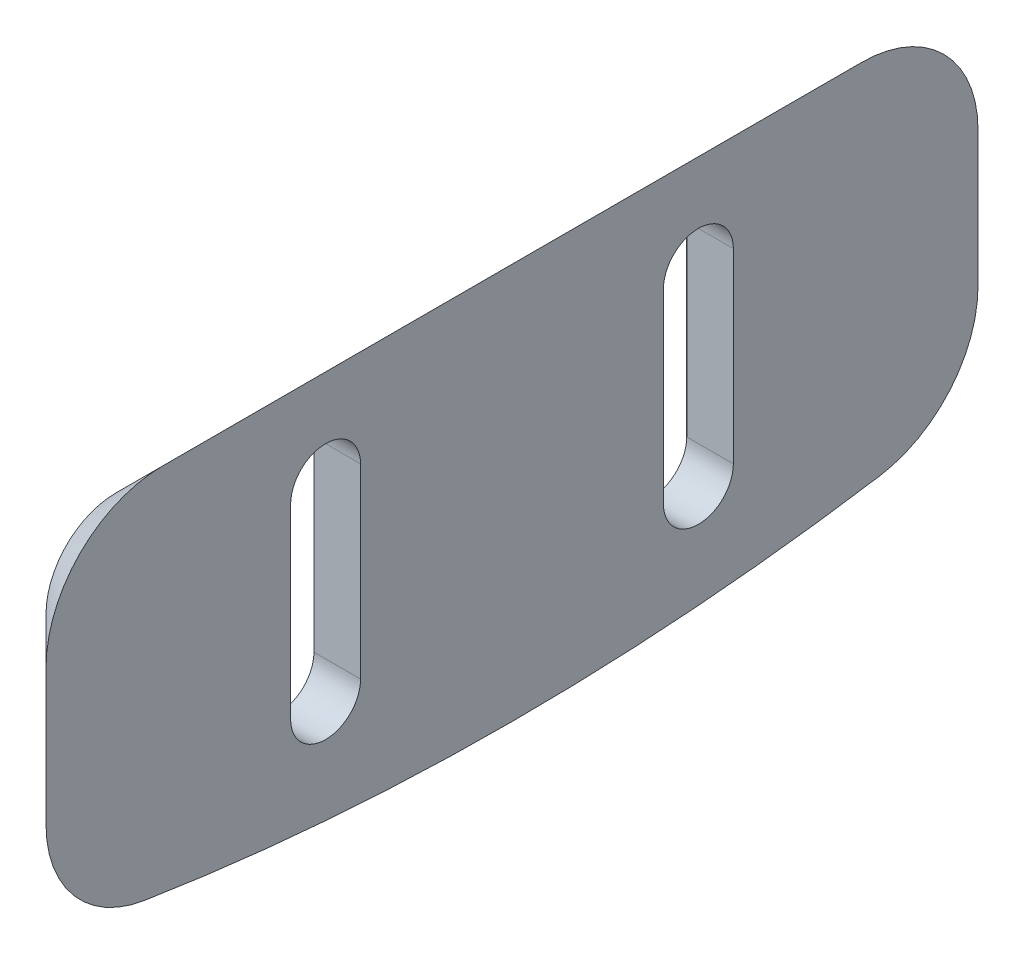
ISO-10303-21;
HEADER;
FILE_DESCRIPTION(('STEP AP214'),'2;1');
FILE_NAME('part.step','',(''),(''),'','','');
FILE_SCHEMA(('AUTOMOTIVE_DESIGN { 1 0 10303 214 1 1 1 1 }'));
ENDSEC;
DATA;
#1=APPLICATION_CONTEXT('core data for automotive mechanical design processes');
#2=APPLICATION_PROTOCOL_DEFINITION('international standard','automotive_design',2000,#1);
#3=PRODUCT_CONTEXT('',#1,'mechanical');
#4=PRODUCT('Part','Part','',(#3));
#5=PRODUCT_RELATED_PRODUCT_CATEGORY('part','',(#4));
#6=PRODUCT_DEFINITION_FORMATION('','',#4);
#7=PRODUCT_DEFINITION_CONTEXT('part definition',#1,'design');
#8=PRODUCT_DEFINITION('design','',#6,#7);
#9=PRODUCT_DEFINITION_SHAPE('','',#8);
#10=(LENGTH_UNIT() NAMED_UNIT(*) SI_UNIT(.MILLI.,.METRE.));
#11=(NAMED_UNIT(*) PLANE_ANGLE_UNIT() SI_UNIT($,.RADIAN.));
#12=(NAMED_UNIT(*) SI_UNIT($,.STERADIAN.) SOLID_ANGLE_UNIT());
#13=UNCERTAINTY_MEASURE_WITH_UNIT(LENGTH_MEASURE(1.E-05),#10,'distance_accuracy_value','');
#14=(GEOMETRIC_REPRESENTATION_CONTEXT(3) GLOBAL_UNCERTAINTY_ASSIGNED_CONTEXT((#13)) GLOBAL_UNIT_ASSIGNED_CONTEXT((#10,
#11,#12)) REPRESENTATION_CONTEXT('',''));
#15=CARTESIAN_POINT('',(0.,0.,0.));
#16=DIRECTION('',(0.,0.,1.));
#17=DIRECTION('',(1.,0.,0.));
#18=AXIS2_PLACEMENT_3D('',#15,#16,#17);
#19=CARTESIAN_POINT('',(2.,101.,0.));
#20=DIRECTION('',(1.,0.,0.));
#21=DIRECTION('',(0.,0.,-1.));
#22=AXIS2_PLACEMENT_3D('',#19,#20,#21);
#23=PLANE('',#22);
#24=CARTESIAN_POINT('',(2.,4.83217793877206,8.));
#25=DIRECTION('',(1.,0.,0.));
#26=DIRECTION('',(0.,0.,-1.));
#27=AXIS2_PLACEMENT_3D('',#24,#25,#26);
#28=CIRCLE('',#27,1.5);
#29=CARTESIAN_POINT('',(2.,4.83217793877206,9.5));
#30=VERTEX_POINT('',#29);
#31=CARTESIAN_POINT('',(2.,4.83217793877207,6.5));
#32=VERTEX_POINT('',#31);
#33=EDGE_CURVE('E164',#30,#32,#28,.T.);
#34=ORIENTED_EDGE('',*,*,#33,.F.);
#35=DIRECTION('',(0.,-1.,0.));
#36=VECTOR('',#35,1.);
#37=CARTESIAN_POINT('',(2.,4.83217793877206,9.5));
#38=LINE('',#37,#36);
#39=CARTESIAN_POINT('',(2.,12.8321779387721,9.5));
#40=VERTEX_POINT('',#39);
#41=EDGE_CURVE('E182',#40,#30,#38,.T.);
#42=ORIENTED_EDGE('',*,*,#41,.F.);
#43=CARTESIAN_POINT('',(2.,12.8321779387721,8.));
#44=DIRECTION('',(1.,0.,0.));
#45=DIRECTION('',(0.,0.,-1.));
#46=AXIS2_PLACEMENT_3D('',#43,#44,#45);
#47=CIRCLE('',#46,1.5);
#48=CARTESIAN_POINT('',(2.,12.8321779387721,6.5));
#49=VERTEX_POINT('',#48);
#50=EDGE_CURVE('E185',#49,#40,#47,.T.);
#51=ORIENTED_EDGE('',*,*,#50,.F.);
#52=DIRECTION('',(0.,1.,0.));
#53=VECTOR('',#52,1.);
#54=CARTESIAN_POINT('',(2.,4.83217793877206,6.5));
#55=LINE('',#54,#53);
#56=EDGE_CURVE('E191',#32,#49,#55,.T.);
#57=ORIENTED_EDGE('',*,*,#56,.F.);
#58=EDGE_LOOP('',(#34,#42,#51,#57));
#59=FACE_BOUND('',#58,.T.);
#60=CARTESIAN_POINT('',(2.,4.83217793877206,-8.));
#61=DIRECTION('',(1.,0.,0.));
#62=DIRECTION('',(0.,0.,1.));
#63=AXIS2_PLACEMENT_3D('',#60,#61,#62);
#64=CIRCLE('',#63,1.5);
#65=CARTESIAN_POINT('',(2.,4.83217793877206,-6.5));
#66=VERTEX_POINT('',#65);
#67=CARTESIAN_POINT('',(2.,4.83217793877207,-9.5));
#68=VERTEX_POINT('',#67);
#69=EDGE_CURVE('E192',#66,#68,#64,.T.);
#70=ORIENTED_EDGE('',*,*,#69,.F.);
#71=DIRECTION('',(0.,-1.,0.));
#72=VECTOR('',#71,1.);
#73=CARTESIAN_POINT('',(2.,4.83217793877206,-6.5));
#74=LINE('',#73,#72);
#75=CARTESIAN_POINT('',(2.,12.8321779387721,-6.5));
#76=VERTEX_POINT('',#75);
#77=EDGE_CURVE('E212',#76,#66,#74,.T.);
#78=ORIENTED_EDGE('',*,*,#77,.F.);
#79=CARTESIAN_POINT('',(2.,12.8321779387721,-8.));
#80=DIRECTION('',(1.,0.,0.));
#81=DIRECTION('',(0.,0.,1.));
#82=AXIS2_PLACEMENT_3D('',#79,#80,#81);
#83=CIRCLE('',#82,1.5);
#84=CARTESIAN_POINT('',(2.,12.8321779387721,-9.5));
#85=VERTEX_POINT('',#84);
#86=EDGE_CURVE('E215',#85,#76,#83,.T.);
#87=ORIENTED_EDGE('',*,*,#86,.F.);
#88=DIRECTION('',(0.,1.,0.));
#89=VECTOR('',#88,1.);
#90=CARTESIAN_POINT('',(2.,4.83217793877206,-9.5));
#91=LINE('',#90,#89);
#92=EDGE_CURVE('E219',#68,#85,#91,.T.);
#93=ORIENTED_EDGE('',*,*,#92,.F.);
#94=EDGE_LOOP('',(#70,#78,#87,#93));
#95=FACE_BOUND('',#94,.T.);
#96=DIRECTION('',(0.,1.,0.));
#97=VECTOR('',#96,1.);
#98=CARTESIAN_POINT('',(2.,2.,-20.));
#99=LINE('',#98,#97);
#100=CARTESIAN_POINT('',(2.,6.17911622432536,-20.));
#101=VERTEX_POINT('',#100);
#102=CARTESIAN_POINT('',(2.,12.,-20.));
#103=VERTEX_POINT('',#102);
#104=EDGE_CURVE('E198',#101,#103,#99,.T.);
#105=ORIENTED_EDGE('',*,*,#104,.T.);
#106=CARTESIAN_POINT('',(2.,12.,-15.));
#107=DIRECTION('',(1.,0.,0.));
#108=DIRECTION('',(0.,0.,-1.));
#109=AXIS2_PLACEMENT_3D('',#106,#107,#108);
#110=CIRCLE('',#109,5.);
#111=CARTESIAN_POINT('',(2.,17.,-15.));
#112=VERTEX_POINT('',#111);
#113=EDGE_CURVE('E247',#103,#112,#110,.T.);
#114=ORIENTED_EDGE('',*,*,#113,.T.);
#115=DIRECTION('',(0.,0.,1.));
#116=VECTOR('',#115,1.);
#117=CARTESIAN_POINT('',(2.,17.,20.));
#118=LINE('',#117,#116);
#119=CARTESIAN_POINT('',(2.,17.,15.));
#120=VERTEX_POINT('',#119);
#121=EDGE_CURVE('E234',#112,#120,#118,.T.);
#122=ORIENTED_EDGE('',*,*,#121,.T.);
#123=CARTESIAN_POINT('',(2.,12.,15.));
#124=DIRECTION('',(1.,0.,0.));
#125=DIRECTION('',(0.,0.,-1.));
#126=AXIS2_PLACEMENT_3D('',#123,#124,#125);
#127=CIRCLE('',#126,5.);
#128=CARTESIAN_POINT('',(2.,12.,20.));
#129=VERTEX_POINT('',#128);
#130=EDGE_CURVE('E245',#120,#129,#127,.T.);
#131=ORIENTED_EDGE('',*,*,#130,.T.);
#132=DIRECTION('',(0.,-1.,0.));
#133=VECTOR('',#132,1.);
#134=CARTESIAN_POINT('',(2.,2.,20.));
#135=LINE('',#134,#133);
#136=CARTESIAN_POINT('',(2.,6.17911622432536,20.));
#137=VERTEX_POINT('',#136);
#138=EDGE_CURVE('E236',#129,#137,#135,.T.);
#139=ORIENTED_EDGE('',*,*,#138,.T.);
#140=CARTESIAN_POINT('',(2.,6.17911622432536,15.));
#141=DIRECTION('',(1.,0.,0.));
#142=DIRECTION('',(0.,0.,-1.));
#143=AXIS2_PLACEMENT_3D('',#140,#141,#142);
#144=CIRCLE('',#143,5.);
#145=CARTESIAN_POINT('',(2.,1.24052852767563,15.78125));
#146=VERTEX_POINT('',#145);
#147=EDGE_CURVE('E243',#137,#146,#144,.T.);
#148=ORIENTED_EDGE('',*,*,#147,.T.);
#149=CARTESIAN_POINT('',(2.,101.,0.));
#150=DIRECTION('',(1.,0.,0.));
#151=DIRECTION('',(0.,0.,-1.));
#152=AXIS2_PLACEMENT_3D('',#149,#150,#151);
#153=CIRCLE('',#152,101.);
#154=CARTESIAN_POINT('',(2.,1.24052852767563,-15.78125));
#155=VERTEX_POINT('',#154);
#156=EDGE_CURVE('E238',#146,#155,#153,.T.);
#157=ORIENTED_EDGE('',*,*,#156,.T.);
#158=CARTESIAN_POINT('',(2.,6.17911622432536,-15.));
#159=DIRECTION('',(1.,0.,0.));
#160=DIRECTION('',(0.,0.,-1.));
#161=AXIS2_PLACEMENT_3D('',#158,#159,#160);
#162=CIRCLE('',#161,5.);
#163=EDGE_CURVE('E241',#155,#101,#162,.T.);
#164=ORIENTED_EDGE('',*,*,#163,.T.);
#165=EDGE_LOOP('',(#105,#114,#122,#131,#139,#148,#157,#164));
#166=FACE_BOUND('',#165,.T.);
#167=ADVANCED_FACE('F41',(#59,#95,#166),#23,.T.);
#168=CARTESIAN_POINT('',(0.,101.,0.));
#169=DIRECTION('',(1.,0.,0.));
#170=DIRECTION('',(0.,0.,-1.));
#171=AXIS2_PLACEMENT_3D('',#168,#169,#170);
#172=PLANE('',#171);
#173=CARTESIAN_POINT('',(0.,6.17911622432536,-15.));
#174=DIRECTION('',(1.,0.,0.));
#175=DIRECTION('',(0.,0.,-1.));
#176=AXIS2_PLACEMENT_3D('',#173,#174,#175);
#177=CIRCLE('',#176,2.99999999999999);
#178=CARTESIAN_POINT('',(0.,6.17911622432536,-18.));
#179=VERTEX_POINT('',#178);
#180=CARTESIAN_POINT('',(0.,3.21596360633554,-15.46875));
#181=VERTEX_POINT('',#180);
#182=EDGE_CURVE('E51',#179,#181,#177,.F.);
#183=ORIENTED_EDGE('',*,*,#182,.T.);
#184=CARTESIAN_POINT('',(0.,101.,0.));
#185=DIRECTION('',(1.,0.,0.));
#186=DIRECTION('',(0.,0.,-1.));
#187=AXIS2_PLACEMENT_3D('',#184,#185,#186);
#188=CIRCLE('',#187,98.9999999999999);
#189=CARTESIAN_POINT('',(0.,3.21596360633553,15.46875));
#190=VERTEX_POINT('',#189);
#191=EDGE_CURVE('E11',#181,#190,#188,.F.);
#192=ORIENTED_EDGE('',*,*,#191,.T.);
#193=CARTESIAN_POINT('',(0.,6.17911622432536,15.));
#194=DIRECTION('',(1.,0.,0.));
#195=DIRECTION('',(0.,0.,-1.));
#196=AXIS2_PLACEMENT_3D('',#193,#194,#195);
#197=CIRCLE('',#196,3.);
#198=CARTESIAN_POINT('',(0.,6.17911622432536,18.));
#199=VERTEX_POINT('',#198);
#200=EDGE_CURVE('E259',#190,#199,#197,.F.);
#201=ORIENTED_EDGE('',*,*,#200,.T.);
#202=DIRECTION('',(0.,1.,0.));
#203=VECTOR('',#202,1.);
#204=CARTESIAN_POINT('',(0.,101.,18.));
#205=LINE('',#204,#203);
#206=CARTESIAN_POINT('',(0.,12.,18.));
#207=VERTEX_POINT('',#206);
#208=EDGE_CURVE('E255',#199,#207,#205,.T.);
#209=ORIENTED_EDGE('',*,*,#208,.T.);
#210=CARTESIAN_POINT('',(0.,12.,15.));
#211=DIRECTION('',(1.,0.,0.));
#212=DIRECTION('',(0.,0.,-1.));
#213=AXIS2_PLACEMENT_3D('',#210,#211,#212);
#214=CIRCLE('',#213,3.);
#215=CARTESIAN_POINT('',(0.,15.,15.));
#216=VERTEX_POINT('',#215);
#217=EDGE_CURVE('E251',#207,#216,#214,.F.);
#218=ORIENTED_EDGE('',*,*,#217,.T.);
#219=DIRECTION('',(0.,0.,-1.));
#220=VECTOR('',#219,1.);
#221=CARTESIAN_POINT('',(0.,15.,0.));
#222=LINE('',#221,#220);
#223=CARTESIAN_POINT('',(0.,15.,-15.));
#224=VERTEX_POINT('',#223);
#225=EDGE_CURVE('E249',#216,#224,#222,.T.);
#226=ORIENTED_EDGE('',*,*,#225,.T.);
#227=CARTESIAN_POINT('',(0.,12.,-15.));
#228=DIRECTION('',(1.,0.,0.));
#229=DIRECTION('',(0.,0.,-1.));
#230=AXIS2_PLACEMENT_3D('',#227,#228,#229);
#231=CIRCLE('',#230,3.);
#232=CARTESIAN_POINT('',(0.,12.,-18.));
#233=VERTEX_POINT('',#232);
#234=EDGE_CURVE('E253',#224,#233,#231,.F.);
#235=ORIENTED_EDGE('',*,*,#234,.T.);
#236=DIRECTION('',(0.,-1.,0.));
#237=VECTOR('',#236,1.);
#238=CARTESIAN_POINT('',(0.,101.,-18.));
#239=LINE('',#238,#237);
#240=EDGE_CURVE('E257',#233,#179,#239,.T.);
#241=ORIENTED_EDGE('',*,*,#240,.T.);
#242=EDGE_LOOP('',(#183,#192,#201,#209,#218,#226,#235,#241));
#243=FACE_BOUND('',#242,.T.);
#244=DIRECTION('',(0.,-1.,0.));
#245=VECTOR('',#244,1.);
#246=CARTESIAN_POINT('',(0.,4.83217793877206,9.5));
#247=LINE('',#246,#245);
#248=CARTESIAN_POINT('',(0.,12.8321779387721,9.5));
#249=VERTEX_POINT('',#248);
#250=CARTESIAN_POINT('',(0.,4.83217793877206,9.5));
#251=VERTEX_POINT('',#250);
#252=EDGE_CURVE('E169',#249,#251,#247,.T.);
#253=ORIENTED_EDGE('',*,*,#252,.T.);
#254=CARTESIAN_POINT('',(0.,4.83217793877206,8.));
#255=DIRECTION('',(1.,0.,0.));
#256=DIRECTION('',(0.,0.,-1.));
#257=AXIS2_PLACEMENT_3D('',#254,#255,#256);
#258=CIRCLE('',#257,1.5);
#259=CARTESIAN_POINT('',(0.,4.83217793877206,6.5));
#260=VERTEX_POINT('',#259);
#261=EDGE_CURVE('E161',#251,#260,#258,.T.);
#262=ORIENTED_EDGE('',*,*,#261,.T.);
#263=DIRECTION('',(0.,1.,0.));
#264=VECTOR('',#263,1.);
#265=CARTESIAN_POINT('',(0.,4.83217793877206,6.5));
#266=LINE('',#265,#264);
#267=CARTESIAN_POINT('',(0.,12.8321779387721,6.5));
#268=VERTEX_POINT('',#267);
#269=EDGE_CURVE('E173',#260,#268,#266,.T.);
#270=ORIENTED_EDGE('',*,*,#269,.T.);
#271=CARTESIAN_POINT('',(0.,12.8321779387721,8.));
#272=DIRECTION('',(1.,0.,0.));
#273=DIRECTION('',(0.,0.,-1.));
#274=AXIS2_PLACEMENT_3D('',#271,#272,#273);
#275=CIRCLE('',#274,1.5);
#276=EDGE_CURVE('E177',#268,#249,#275,.T.);
#277=ORIENTED_EDGE('',*,*,#276,.T.);
#278=EDGE_LOOP('',(#253,#262,#270,#277));
#279=FACE_BOUND('',#278,.T.);
#280=DIRECTION('',(0.,-1.,0.));
#281=VECTOR('',#280,1.);
#282=CARTESIAN_POINT('',(0.,4.83217793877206,-6.5));
#283=LINE('',#282,#281);
#284=CARTESIAN_POINT('',(0.,12.8321779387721,-6.5));
#285=VERTEX_POINT('',#284);
#286=CARTESIAN_POINT('',(0.,4.83217793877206,-6.5));
#287=VERTEX_POINT('',#286);
#288=EDGE_CURVE('E205',#285,#287,#283,.T.);
#289=ORIENTED_EDGE('',*,*,#288,.T.);
#290=CARTESIAN_POINT('',(0.,4.83217793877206,-8.));
#291=DIRECTION('',(1.,0.,0.));
#292=DIRECTION('',(0.,0.,1.));
#293=AXIS2_PLACEMENT_3D('',#290,#291,#292);
#294=CIRCLE('',#293,1.5);
#295=CARTESIAN_POINT('',(0.,4.83217793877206,-9.5));
#296=VERTEX_POINT('',#295);
#297=EDGE_CURVE('E216',#287,#296,#294,.T.);
#298=ORIENTED_EDGE('',*,*,#297,.T.);
#299=DIRECTION('',(0.,1.,0.));
#300=VECTOR('',#299,1.);
#301=CARTESIAN_POINT('',(0.,4.83217793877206,-9.5));
#302=LINE('',#301,#300);
#303=CARTESIAN_POINT('',(0.,12.8321779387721,-9.5));
#304=VERTEX_POINT('',#303);
#305=EDGE_CURVE('E228',#296,#304,#302,.T.);
#306=ORIENTED_EDGE('',*,*,#305,.T.);
#307=CARTESIAN_POINT('',(0.,12.8321779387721,-8.));
#308=DIRECTION('',(1.,0.,0.));
#309=DIRECTION('',(0.,0.,1.));
#310=AXIS2_PLACEMENT_3D('',#307,#308,#309);
#311=CIRCLE('',#310,1.5);
#312=EDGE_CURVE('E225',#304,#285,#311,.T.);
#313=ORIENTED_EDGE('',*,*,#312,.T.);
#314=EDGE_LOOP('',(#289,#298,#306,#313));
#315=FACE_BOUND('',#314,.T.);
#316=ADVANCED_FACE('F179',(#243,#279,#315),#172,.F.);
#317=CARTESIAN_POINT('',(0.,4.83217793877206,-8.));
#318=DIRECTION('',(1.,0.,0.));
#319=DIRECTION('',(0.,0.,-1.));
#320=AXIS2_PLACEMENT_3D('',#317,#318,#319);
#321=CYLINDRICAL_SURFACE('',#320,1.5);
#322=ORIENTED_EDGE('',*,*,#69,.T.);
#323=DIRECTION('',(1.,0.,0.));
#324=VECTOR('',#323,1.);
#325=CARTESIAN_POINT('',(0.,4.83217793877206,-9.5));
#326=LINE('',#325,#324);
#327=EDGE_CURVE('E202',#296,#68,#326,.T.);
#328=ORIENTED_EDGE('',*,*,#327,.F.);
#329=ORIENTED_EDGE('',*,*,#297,.F.);
#330=DIRECTION('',(1.,0.,0.));
#331=VECTOR('',#330,1.);
#332=CARTESIAN_POINT('',(0.,4.83217793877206,-6.5));
#333=LINE('',#332,#331);
#334=EDGE_CURVE('E210',#287,#66,#333,.T.);
#335=ORIENTED_EDGE('',*,*,#334,.T.);
#336=EDGE_LOOP('',(#322,#328,#329,#335));
#337=FACE_BOUND('',#336,.T.);
#338=ADVANCED_FACE('F328',(#337),#321,.F.);
#339=CARTESIAN_POINT('',(0.,4.83217793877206,-6.5));
#340=DIRECTION('',(0.,0.,1.));
#341=DIRECTION('',(0.,-1.,0.));
#342=AXIS2_PLACEMENT_3D('',#339,#340,#341);
#343=PLANE('',#342);
#344=ORIENTED_EDGE('',*,*,#77,.T.);
#345=ORIENTED_EDGE('',*,*,#334,.F.);
#346=ORIENTED_EDGE('',*,*,#288,.F.);
#347=DIRECTION('',(1.,0.,0.));
#348=VECTOR('',#347,1.);
#349=CARTESIAN_POINT('',(0.,12.8321779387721,-6.5));
#350=LINE('',#349,#348);
#351=EDGE_CURVE('E208',#285,#76,#350,.T.);
#352=ORIENTED_EDGE('',*,*,#351,.T.);
#353=EDGE_LOOP('',(#344,#345,#346,#352));
#354=FACE_BOUND('',#353,.T.);
#355=ADVANCED_FACE('F331',(#354),#343,.F.);
#356=CARTESIAN_POINT('',(0.,12.8321779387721,-8.));
#357=DIRECTION('',(1.,0.,0.));
#358=DIRECTION('',(0.,0.,-1.));
#359=AXIS2_PLACEMENT_3D('',#356,#357,#358);
#360=CYLINDRICAL_SURFACE('',#359,1.5);
#361=ORIENTED_EDGE('',*,*,#86,.T.);
#362=ORIENTED_EDGE('',*,*,#351,.F.);
#363=ORIENTED_EDGE('',*,*,#312,.F.);
#364=DIRECTION('',(1.,0.,0.));
#365=VECTOR('',#364,1.);
#366=CARTESIAN_POINT('',(0.,12.8321779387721,-9.5));
#367=LINE('',#366,#365);
#368=EDGE_CURVE('E206',#304,#85,#367,.T.);
#369=ORIENTED_EDGE('',*,*,#368,.T.);
#370=EDGE_LOOP('',(#361,#362,#363,#369));
#371=FACE_BOUND('',#370,.T.);
#372=ADVANCED_FACE('F334',(#371),#360,.F.);
#373=CARTESIAN_POINT('',(0.,4.83217793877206,-9.5));
#374=DIRECTION('',(0.,0.,-1.));
#375=DIRECTION('',(0.,1.,0.));
#376=AXIS2_PLACEMENT_3D('',#373,#374,#375);
#377=PLANE('',#376);
#378=ORIENTED_EDGE('',*,*,#92,.T.);
#379=ORIENTED_EDGE('',*,*,#368,.F.);
#380=ORIENTED_EDGE('',*,*,#305,.F.);
#381=ORIENTED_EDGE('',*,*,#327,.T.);
#382=EDGE_LOOP('',(#378,#379,#380,#381));
#383=FACE_BOUND('',#382,.T.);
#384=ADVANCED_FACE('F338',(#383),#377,.F.);
#385=CARTESIAN_POINT('',(0.,4.83217793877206,8.));
#386=DIRECTION('',(1.,0.,0.));
#387=DIRECTION('',(0.,0.,-1.));
#388=AXIS2_PLACEMENT_3D('',#385,#386,#387);
#389=CYLINDRICAL_SURFACE('',#388,1.5);
#390=ORIENTED_EDGE('',*,*,#33,.T.);
#391=DIRECTION('',(1.,0.,0.));
#392=VECTOR('',#391,1.);
#393=CARTESIAN_POINT('',(0.,4.83217793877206,6.5));
#394=LINE('',#393,#392);
#395=EDGE_CURVE('E157',#260,#32,#394,.T.);
#396=ORIENTED_EDGE('',*,*,#395,.F.);
#397=ORIENTED_EDGE('',*,*,#261,.F.);
#398=DIRECTION('',(1.,0.,0.));
#399=VECTOR('',#398,1.);
#400=CARTESIAN_POINT('',(0.,4.83217793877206,9.5));
#401=LINE('',#400,#399);
#402=EDGE_CURVE('E196',#251,#30,#401,.T.);
#403=ORIENTED_EDGE('',*,*,#402,.T.);
#404=EDGE_LOOP('',(#390,#396,#397,#403));
#405=FACE_BOUND('',#404,.T.);
#406=ADVANCED_FACE('F159',(#405),#389,.F.);
#407=CARTESIAN_POINT('',(0.,4.83217793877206,9.5));
#408=DIRECTION('',(0.,0.,1.));
#409=DIRECTION('',(0.,-1.,0.));
#410=AXIS2_PLACEMENT_3D('',#407,#408,#409);
#411=PLANE('',#410);
#412=ORIENTED_EDGE('',*,*,#41,.T.);
#413=ORIENTED_EDGE('',*,*,#402,.F.);
#414=ORIENTED_EDGE('',*,*,#252,.F.);
#415=DIRECTION('',(1.,0.,0.));
#416=VECTOR('',#415,1.);
#417=CARTESIAN_POINT('',(0.,12.8321779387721,9.5));
#418=LINE('',#417,#416);
#419=EDGE_CURVE('E199',#249,#40,#418,.T.);
#420=ORIENTED_EDGE('',*,*,#419,.T.);
#421=EDGE_LOOP('',(#412,#413,#414,#420));
#422=FACE_BOUND('',#421,.T.);
#423=ADVANCED_FACE('F348',(#422),#411,.F.);
#424=CARTESIAN_POINT('',(0.,12.8321779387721,8.));
#425=DIRECTION('',(1.,0.,0.));
#426=DIRECTION('',(0.,0.,-1.));
#427=AXIS2_PLACEMENT_3D('',#424,#425,#426);
#428=CYLINDRICAL_SURFACE('',#427,1.5);
#429=ORIENTED_EDGE('',*,*,#50,.T.);
#430=ORIENTED_EDGE('',*,*,#419,.F.);
#431=ORIENTED_EDGE('',*,*,#276,.F.);
#432=DIRECTION('',(1.,0.,0.));
#433=VECTOR('',#432,1.);
#434=CARTESIAN_POINT('',(0.,12.8321779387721,6.5));
#435=LINE('',#434,#433);
#436=EDGE_CURVE('E168',#268,#49,#435,.T.);
#437=ORIENTED_EDGE('',*,*,#436,.T.);
#438=EDGE_LOOP('',(#429,#430,#431,#437));
#439=FACE_BOUND('',#438,.T.);
#440=ADVANCED_FACE('F350',(#439),#428,.F.);
#441=CARTESIAN_POINT('',(0.,4.83217793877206,6.5));
#442=DIRECTION('',(0.,0.,-1.));
#443=DIRECTION('',(0.,1.,0.));
#444=AXIS2_PLACEMENT_3D('',#441,#442,#443);
#445=PLANE('',#444);
#446=ORIENTED_EDGE('',*,*,#56,.T.);
#447=ORIENTED_EDGE('',*,*,#436,.F.);
#448=ORIENTED_EDGE('',*,*,#269,.F.);
#449=ORIENTED_EDGE('',*,*,#395,.T.);
#450=EDGE_LOOP('',(#446,#447,#448,#449));
#451=FACE_BOUND('',#450,.T.);
#452=ADVANCED_FACE('F174',(#451),#445,.F.);
#453=CARTESIAN_POINT('',(2.,17.,20.));
#454=DIRECTION('',(0.707106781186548,-0.707106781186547,0.));
#455=DIRECTION('',(0.,0.,1.));
#456=AXIS2_PLACEMENT_3D('',#453,#454,#455);
#457=PLANE('',#456);
#458=DIRECTION('',(0.707106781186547,0.707106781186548,0.));
#459=VECTOR('',#458,1.);
#460=CARTESIAN_POINT('',(0.,15.,-15.));
#461=LINE('',#460,#459);
#462=EDGE_CURVE('E276',#224,#112,#461,.T.);
#463=ORIENTED_EDGE('',*,*,#462,.F.);
#464=ORIENTED_EDGE('',*,*,#225,.F.);
#465=DIRECTION('',(-0.707106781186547,-0.707106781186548,0.));
#466=VECTOR('',#465,1.);
#467=CARTESIAN_POINT('',(2.,17.,15.));
#468=LINE('',#467,#466);
#469=EDGE_CURVE('E46',#120,#216,#468,.T.);
#470=ORIENTED_EDGE('',*,*,#469,.F.);
#471=ORIENTED_EDGE('',*,*,#121,.F.);
#472=EDGE_LOOP('',(#463,#464,#470,#471));
#473=FACE_BOUND('',#472,.T.);
#474=ADVANCED_FACE('F44',(#473),#457,.F.);
#475=CARTESIAN_POINT('',(0.,12.,15.));
#476=DIRECTION('',(1.,0.,0.));
#477=DIRECTION('',(0.,0.,-1.));
#478=AXIS2_PLACEMENT_3D('',#475,#476,#477);
#479=CONICAL_SURFACE('',#478,3.,0.78539816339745);
#480=ORIENTED_EDGE('',*,*,#469,.T.);
#481=ORIENTED_EDGE('',*,*,#217,.F.);
#482=DIRECTION('',(-0.707106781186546,0.,-0.707106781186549));
#483=VECTOR('',#482,1.);
#484=CARTESIAN_POINT('',(2.,12.,20.));
#485=LINE('',#484,#483);
#486=EDGE_CURVE('E274',#129,#207,#485,.T.);
#487=ORIENTED_EDGE('',*,*,#486,.F.);
#488=ORIENTED_EDGE('',*,*,#130,.F.);
#489=EDGE_LOOP('',(#480,#481,#487,#488));
#490=FACE_BOUND('',#489,.T.);
#491=ADVANCED_FACE('F287',(#490),#479,.T.);
#492=CARTESIAN_POINT('',(0.,12.,-15.));
#493=DIRECTION('',(1.,0.,0.));
#494=DIRECTION('',(0.,0.,-1.));
#495=AXIS2_PLACEMENT_3D('',#492,#493,#494);
#496=CONICAL_SURFACE('',#495,3.,0.78539816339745);
#497=ORIENTED_EDGE('',*,*,#462,.T.);
#498=ORIENTED_EDGE('',*,*,#113,.F.);
#499=DIRECTION('',(0.707106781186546,0.,-0.707106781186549));
#500=VECTOR('',#499,1.);
#501=CARTESIAN_POINT('',(0.,12.,-18.));
#502=LINE('',#501,#500);
#503=EDGE_CURVE('E271',#233,#103,#502,.T.);
#504=ORIENTED_EDGE('',*,*,#503,.F.);
#505=ORIENTED_EDGE('',*,*,#234,.F.);
#506=EDGE_LOOP('',(#497,#498,#504,#505));
#507=FACE_BOUND('',#506,.T.);
#508=ADVANCED_FACE('F303',(#507),#496,.T.);
#509=CARTESIAN_POINT('',(2.,2.,20.));
#510=DIRECTION('',(0.707106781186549,0.,-0.707106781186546));
#511=DIRECTION('',(0.,-1.,0.));
#512=AXIS2_PLACEMENT_3D('',#509,#510,#511);
#513=PLANE('',#512);
#514=ORIENTED_EDGE('',*,*,#486,.T.);
#515=ORIENTED_EDGE('',*,*,#208,.F.);
#516=DIRECTION('',(-0.707106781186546,0.,-0.707106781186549));
#517=VECTOR('',#516,1.);
#518=CARTESIAN_POINT('',(2.,6.17911622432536,20.));
#519=LINE('',#518,#517);
#520=EDGE_CURVE('E268',#137,#199,#519,.T.);
#521=ORIENTED_EDGE('',*,*,#520,.F.);
#522=ORIENTED_EDGE('',*,*,#138,.F.);
#523=EDGE_LOOP('',(#514,#515,#521,#522));
#524=FACE_BOUND('',#523,.T.);
#525=ADVANCED_FACE('F296',(#524),#513,.F.);
#526=CARTESIAN_POINT('',(2.,2.,-20.));
#527=DIRECTION('',(0.707106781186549,0.,0.707106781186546));
#528=DIRECTION('',(0.,1.,0.));
#529=AXIS2_PLACEMENT_3D('',#526,#527,#528);
#530=PLANE('',#529);
#531=ORIENTED_EDGE('',*,*,#503,.T.);
#532=ORIENTED_EDGE('',*,*,#104,.F.);
#533=DIRECTION('',(0.707106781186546,0.,-0.707106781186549));
#534=VECTOR('',#533,1.);
#535=CARTESIAN_POINT('',(0.,6.17911622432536,-18.));
#536=LINE('',#535,#534);
#537=EDGE_CURVE('E265',#179,#101,#536,.T.);
#538=ORIENTED_EDGE('',*,*,#537,.F.);
#539=ORIENTED_EDGE('',*,*,#240,.F.);
#540=EDGE_LOOP('',(#531,#532,#538,#539));
#541=FACE_BOUND('',#540,.T.);
#542=ADVANCED_FACE('F306',(#541),#530,.F.);
#543=CARTESIAN_POINT('',(0.,6.17911622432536,15.));
#544=DIRECTION('',(1.,0.,0.));
#545=DIRECTION('',(0.,0.,-1.));
#546=AXIS2_PLACEMENT_3D('',#543,#544,#545);
#547=CONICAL_SURFACE('',#546,3.,0.78539816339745);
#548=ORIENTED_EDGE('',*,*,#520,.T.);
#549=ORIENTED_EDGE('',*,*,#200,.F.);
#550=DIRECTION('',(-0.707106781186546,0.698421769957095,-0.110485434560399));
#551=VECTOR('',#550,1.);
#552=CARTESIAN_POINT('',(2.,1.24052852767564,15.78125));
#553=LINE('',#552,#551);
#554=EDGE_CURVE('E64',#146,#190,#553,.T.);
#555=ORIENTED_EDGE('',*,*,#554,.F.);
#556=ORIENTED_EDGE('',*,*,#147,.F.);
#557=EDGE_LOOP('',(#548,#549,#555,#556));
#558=FACE_BOUND('',#557,.T.);
#559=ADVANCED_FACE('F300',(#558),#547,.T.);
#560=CARTESIAN_POINT('',(0.,6.17911622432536,-15.));
#561=DIRECTION('',(1.,0.,0.));
#562=DIRECTION('',(0.,0.,-1.));
#563=AXIS2_PLACEMENT_3D('',#560,#561,#562);
#564=CONICAL_SURFACE('',#563,3.,0.78539816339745);
#565=ORIENTED_EDGE('',*,*,#537,.T.);
#566=ORIENTED_EDGE('',*,*,#163,.F.);
#567=DIRECTION('',(0.707106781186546,-0.698421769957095,-0.110485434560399));
#568=VECTOR('',#567,1.);
#569=CARTESIAN_POINT('',(0.,3.21596360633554,-15.46875));
#570=LINE('',#569,#568);
#571=EDGE_CURVE('E262',#181,#155,#570,.T.);
#572=ORIENTED_EDGE('',*,*,#571,.F.);
#573=ORIENTED_EDGE('',*,*,#182,.F.);
#574=EDGE_LOOP('',(#565,#566,#572,#573));
#575=FACE_BOUND('',#574,.T.);
#576=ADVANCED_FACE('F311',(#575),#564,.T.);
#577=CARTESIAN_POINT('',(2.,101.,0.));
#578=DIRECTION('',(1.,0.,0.));
#579=DIRECTION('',(0.,0.,-1.));
#580=AXIS2_PLACEMENT_3D('',#577,#578,#579);
#581=CONICAL_SURFACE('',#580,101.,0.785398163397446);
#582=ORIENTED_EDGE('',*,*,#554,.T.);
#583=ORIENTED_EDGE('',*,*,#191,.F.);
#584=ORIENTED_EDGE('',*,*,#571,.T.);
#585=ORIENTED_EDGE('',*,*,#156,.F.);
#586=EDGE_LOOP('',(#582,#583,#584,#585));
#587=FACE_BOUND('',#586,.T.);
#588=ADVANCED_FACE('F312',(#587),#581,.T.);
#589=CLOSED_SHELL('',(#167,#316,#338,#355,#372,#384,#406,#423,#440,#452,#474,#491,#508,#525,
#542,#559,#576,#588));
#590=MANIFOLD_SOLID_BREP('B2',#589);
#591=ADVANCED_BREP_SHAPE_REPRESENTATION('',(#18,#590),#14);
#592=SHAPE_DEFINITION_REPRESENTATION(#9,#591);
ENDSEC;
END-ISO-10303-21;
